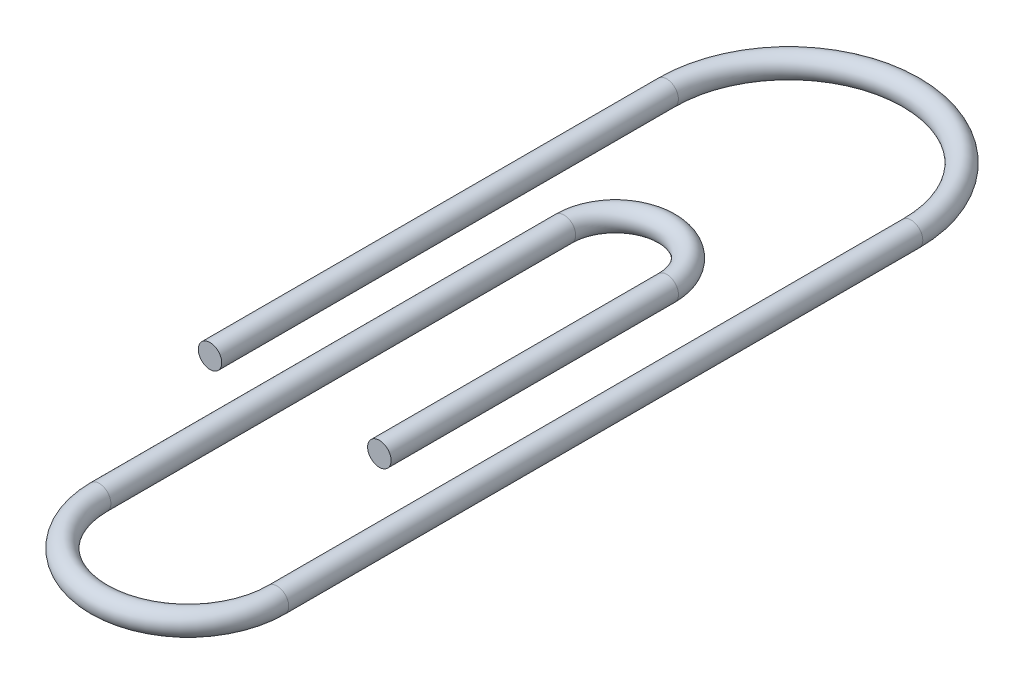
ISO-10303-21;
HEADER;
FILE_DESCRIPTION(('STEP AP214'),'2;1');
FILE_NAME('part.step','',(''),(''),'','','');
FILE_SCHEMA(('AUTOMOTIVE_DESIGN { 1 0 10303 214 1 1 1 1 }'));
ENDSEC;
DATA;
#1=APPLICATION_CONTEXT('core data for automotive mechanical design processes');
#2=APPLICATION_PROTOCOL_DEFINITION('international standard','automotive_design',2000,#1);
#3=PRODUCT_CONTEXT('',#1,'mechanical');
#4=PRODUCT('Part','Part','',(#3));
#5=PRODUCT_RELATED_PRODUCT_CATEGORY('part','',(#4));
#6=PRODUCT_DEFINITION_FORMATION('','',#4);
#7=PRODUCT_DEFINITION_CONTEXT('part definition',#1,'design');
#8=PRODUCT_DEFINITION('design','',#6,#7);
#9=PRODUCT_DEFINITION_SHAPE('','',#8);
#10=(LENGTH_UNIT() NAMED_UNIT(*) SI_UNIT(.MILLI.,.METRE.));
#11=(NAMED_UNIT(*) PLANE_ANGLE_UNIT() SI_UNIT($,.RADIAN.));
#12=(NAMED_UNIT(*) SI_UNIT($,.STERADIAN.) SOLID_ANGLE_UNIT());
#13=UNCERTAINTY_MEASURE_WITH_UNIT(LENGTH_MEASURE(1.E-05),#10,'distance_accuracy_value','');
#14=(GEOMETRIC_REPRESENTATION_CONTEXT(3) GLOBAL_UNCERTAINTY_ASSIGNED_CONTEXT((#13)) GLOBAL_UNIT_ASSIGNED_CONTEXT((#10,
#11,#12)) REPRESENTATION_CONTEXT('',''));
#15=CARTESIAN_POINT('',(0.,0.,0.));
#16=DIRECTION('',(0.,0.,1.));
#17=DIRECTION('',(1.,0.,0.));
#18=AXIS2_PLACEMENT_3D('',#15,#16,#17);
#19=CARTESIAN_POINT('',(45.8129627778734,0.,-77.7555136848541));
#20=DIRECTION('',(0.,0.,1.));
#21=DIRECTION('',(1.,0.,0.));
#22=AXIS2_PLACEMENT_3D('',#19,#20,#21);
#23=CYLINDRICAL_SURFACE('',#22,3.175);
#24=CARTESIAN_POINT('',(45.8129627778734,0.,-77.7555136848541));
#25=DIRECTION('',(0.,0.,-1.));
#26=DIRECTION('',(-1.,0.,0.));
#27=AXIS2_PLACEMENT_3D('',#24,#25,#26);
#28=CIRCLE('',#27,3.175);
#29=CARTESIAN_POINT('',(48.9879627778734,0.,-77.7555136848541));
#30=VERTEX_POINT('',#29);
#31=EDGE_CURVE('E30',#30,#30,#28,.T.);
#32=ORIENTED_EDGE('',*,*,#31,.F.);
#33=EDGE_LOOP('',(#32));
#34=FACE_BOUND('',#33,.T.);
#35=CARTESIAN_POINT('',(45.8129627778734,0.,0.));
#36=DIRECTION('',(0.,0.,-1.));
#37=DIRECTION('',(-1.,0.,0.));
#38=AXIS2_PLACEMENT_3D('',#35,#36,#37);
#39=CIRCLE('',#38,3.175);
#40=CARTESIAN_POINT('',(42.6379627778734,0.,0.));
#41=VERTEX_POINT('',#40);
#42=EDGE_CURVE('E10',#41,#41,#39,.T.);
#43=ORIENTED_EDGE('',*,*,#42,.T.);
#44=EDGE_LOOP('',(#43));
#45=FACE_BOUND('',#44,.T.);
#46=ADVANCED_FACE('F24',(#34,#45),#23,.T.);
#47=CARTESIAN_POINT('',(31.9085299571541,0.,-77.7555136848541));
#48=DIRECTION('',(0.,-1.,0.));
#49=DIRECTION('',(0.,0.,-1.));
#50=AXIS2_PLACEMENT_3D('',#47,#48,#49);
#51=TOROIDAL_SURFACE('',#50,13.9044328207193,3.175);
#52=CARTESIAN_POINT('',(18.0040971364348,0.,-77.7555136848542));
#53=DIRECTION('',(0.,0.,1.));
#54=DIRECTION('',(1.,0.,0.));
#55=AXIS2_PLACEMENT_3D('',#52,#53,#54);
#56=CIRCLE('',#55,3.175);
#57=CARTESIAN_POINT('',(14.8290971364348,0.,-77.7555136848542));
#58=VERTEX_POINT('',#57);
#59=EDGE_CURVE('E34',#58,#58,#56,.T.);
#60=CARTESIAN_POINT('',(31.9085299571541,0.,-77.7555136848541));
#61=DIRECTION('',(0.,-1.,0.));
#62=DIRECTION('',(0.,0.,-1.));
#63=AXIS2_PLACEMENT_3D('',#60,#61,#62);
#64=CIRCLE('',#63,17.0794328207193);
#65=EDGE_CURVE('',#58,#30,#64,.T.);
#66=ORIENTED_EDGE('',*,*,#59,.F.);
#67=ORIENTED_EDGE('',*,*,#31,.T.);
#68=ORIENTED_EDGE('',*,*,#65,.T.);
#69=ORIENTED_EDGE('',*,*,#65,.F.);
#70=EDGE_LOOP('',(#66,#68,#67,#69));
#71=FACE_BOUND('',#70,.T.);
#72=ADVANCED_FACE('F74',(#71),#51,.T.);
#73=CARTESIAN_POINT('',(18.0040971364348,0.,47.9889222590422));
#74=DIRECTION('',(0.,0.,-1.));
#75=DIRECTION('',(-1.,0.,0.));
#76=AXIS2_PLACEMENT_3D('',#73,#74,#75);
#77=CYLINDRICAL_SURFACE('',#76,3.175);
#78=CARTESIAN_POINT('',(18.0040971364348,0.,47.9889222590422));
#79=DIRECTION('',(0.,0.,1.));
#80=DIRECTION('',(1.,0.,0.));
#81=AXIS2_PLACEMENT_3D('',#78,#79,#80);
#82=CIRCLE('',#81,3.175);
#83=CARTESIAN_POINT('',(14.8290971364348,0.,47.9889222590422));
#84=VERTEX_POINT('',#83);
#85=EDGE_CURVE('E38',#84,#84,#82,.T.);
#86=ORIENTED_EDGE('',*,*,#85,.F.);
#87=EDGE_LOOP('',(#86));
#88=FACE_BOUND('',#87,.T.);
#89=ORIENTED_EDGE('',*,*,#59,.T.);
#90=EDGE_LOOP('',(#89));
#91=FACE_BOUND('',#90,.T.);
#92=ADVANCED_FACE('F79',(#88,#91),#77,.T.);
#93=CARTESIAN_POINT('',(42.0604731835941,0.,47.9889222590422));
#94=DIRECTION('',(0.,-1.,0.));
#95=DIRECTION('',(0.,0.,-1.));
#96=AXIS2_PLACEMENT_3D('',#93,#94,#95);
#97=TOROIDAL_SURFACE('',#96,24.0563760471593,3.175);
#98=CARTESIAN_POINT('',(66.1168492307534,0.,47.9889222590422));
#99=DIRECTION('',(0.,0.,-1.));
#100=DIRECTION('',(-1.,0.,0.));
#101=AXIS2_PLACEMENT_3D('',#98,#99,#100);
#102=CIRCLE('',#101,3.175);
#103=CARTESIAN_POINT('',(69.2918492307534,0.,47.9889222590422));
#104=VERTEX_POINT('',#103);
#105=EDGE_CURVE('E43',#104,#104,#102,.T.);
#106=CARTESIAN_POINT('',(42.0604731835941,0.,47.9889222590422));
#107=DIRECTION('',(0.,-1.,0.));
#108=DIRECTION('',(0.,0.,-1.));
#109=AXIS2_PLACEMENT_3D('',#106,#107,#108);
#110=CIRCLE('',#109,27.2313760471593);
#111=EDGE_CURVE('',#104,#84,#110,.T.);
#112=ORIENTED_EDGE('',*,*,#105,.F.);
#113=ORIENTED_EDGE('',*,*,#85,.T.);
#114=ORIENTED_EDGE('',*,*,#111,.T.);
#115=ORIENTED_EDGE('',*,*,#111,.F.);
#116=EDGE_LOOP('',(#112,#114,#113,#115));
#117=FACE_BOUND('',#116,.T.);
#118=ADVANCED_FACE('F84',(#117),#97,.T.);
#119=CARTESIAN_POINT('',(66.1168492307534,0.,-123.542123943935));
#120=DIRECTION('',(0.,0.,1.));
#121=DIRECTION('',(1.,0.,0.));
#122=AXIS2_PLACEMENT_3D('',#119,#120,#121);
#123=CYLINDRICAL_SURFACE('',#122,3.175);
#124=CARTESIAN_POINT('',(66.1168492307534,0.,-123.542123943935));
#125=DIRECTION('',(0.,0.,-1.));
#126=DIRECTION('',(-1.,0.,0.));
#127=AXIS2_PLACEMENT_3D('',#124,#125,#126);
#128=CIRCLE('',#127,3.175);
#129=CARTESIAN_POINT('',(69.2918492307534,0.,-123.542123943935));
#130=VERTEX_POINT('',#129);
#131=EDGE_CURVE('E46',#130,#130,#128,.T.);
#132=ORIENTED_EDGE('',*,*,#131,.F.);
#133=EDGE_LOOP('',(#132));
#134=FACE_BOUND('',#133,.T.);
#135=ORIENTED_EDGE('',*,*,#105,.T.);
#136=EDGE_LOOP('',(#135));
#137=FACE_BOUND('',#136,.T.);
#138=ADVANCED_FACE('F70',(#134,#137),#123,.T.);
#139=CARTESIAN_POINT('',(33.0584246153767,0.,-123.542123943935));
#140=DIRECTION('',(0.,-1.,0.));
#141=DIRECTION('',(0.,0.,-1.));
#142=AXIS2_PLACEMENT_3D('',#139,#140,#141);
#143=TOROIDAL_SURFACE('',#142,33.0584246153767,3.175);
#144=CARTESIAN_POINT('',(0.,0.,-123.542123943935));
#145=DIRECTION('',(0.,0.,1.));
#146=DIRECTION('',(1.,0.,0.));
#147=AXIS2_PLACEMENT_3D('',#144,#145,#146);
#148=CIRCLE('',#147,3.175);
#149=CARTESIAN_POINT('',(-3.175,0.,-123.542123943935));
#150=VERTEX_POINT('',#149);
#151=EDGE_CURVE('E49',#150,#150,#148,.T.);
#152=CARTESIAN_POINT('',(33.0584246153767,0.,-123.542123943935));
#153=DIRECTION('',(0.,-1.,0.));
#154=DIRECTION('',(0.,0.,-1.));
#155=AXIS2_PLACEMENT_3D('',#152,#153,#154);
#156=CIRCLE('',#155,36.2334246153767);
#157=EDGE_CURVE('',#150,#130,#156,.T.);
#158=ORIENTED_EDGE('',*,*,#151,.F.);
#159=ORIENTED_EDGE('',*,*,#131,.T.);
#160=ORIENTED_EDGE('',*,*,#157,.T.);
#161=ORIENTED_EDGE('',*,*,#157,.F.);
#162=EDGE_LOOP('',(#158,#160,#159,#161));
#163=FACE_BOUND('',#162,.T.);
#164=ADVANCED_FACE('F61',(#163),#143,.T.);
#165=CARTESIAN_POINT('',(0.,0.,-123.542123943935));
#166=DIRECTION('',(0.,0.,1.));
#167=DIRECTION('',(1.,0.,0.));
#168=AXIS2_PLACEMENT_3D('',#165,#166,#167);
#169=CYLINDRICAL_SURFACE('',#168,3.175);
#170=ORIENTED_EDGE('',*,*,#151,.T.);
#171=EDGE_LOOP('',(#170));
#172=FACE_BOUND('',#171,.T.);
#173=CARTESIAN_POINT('',(0.,0.,0.));
#174=DIRECTION('',(0.,0.,1.));
#175=DIRECTION('',(1.,0.,0.));
#176=AXIS2_PLACEMENT_3D('',#173,#174,#175);
#177=CIRCLE('',#176,3.175);
#178=CARTESIAN_POINT('',(3.175,0.,0.));
#179=VERTEX_POINT('',#178);
#180=EDGE_CURVE('E52',#179,#179,#177,.T.);
#181=ORIENTED_EDGE('',*,*,#180,.F.);
#182=EDGE_LOOP('',(#181));
#183=FACE_BOUND('',#182,.T.);
#184=ADVANCED_FACE('F58',(#172,#183),#169,.T.);
#185=CARTESIAN_POINT('',(45.8129627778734,0.,0.));
#186=DIRECTION('',(0.,0.,-1.));
#187=DIRECTION('',(-1.,0.,0.));
#188=AXIS2_PLACEMENT_3D('',#185,#186,#187);
#189=PLANE('',#188);
#190=ORIENTED_EDGE('',*,*,#42,.F.);
#191=EDGE_LOOP('',(#190));
#192=FACE_BOUND('',#191,.T.);
#193=ADVANCED_FACE('F60',(#192),#189,.F.);
#194=CARTESIAN_POINT('',(0.,0.,0.));
#195=DIRECTION('',(0.,0.,1.));
#196=DIRECTION('',(1.,0.,0.));
#197=AXIS2_PLACEMENT_3D('',#194,#195,#196);
#198=PLANE('',#197);
#199=ORIENTED_EDGE('',*,*,#180,.T.);
#200=EDGE_LOOP('',(#199));
#201=FACE_BOUND('',#200,.T.);
#202=ADVANCED_FACE('F56',(#201),#198,.T.);
#203=CLOSED_SHELL('',(#46,#72,#92,#118,#138,#164,#184,#193,#202));
#204=MANIFOLD_SOLID_BREP('B2',#203);
#205=ADVANCED_BREP_SHAPE_REPRESENTATION('',(#18,#204),#14);
#206=SHAPE_DEFINITION_REPRESENTATION(#9,#205);
ENDSEC;
END-ISO-10303-21;
